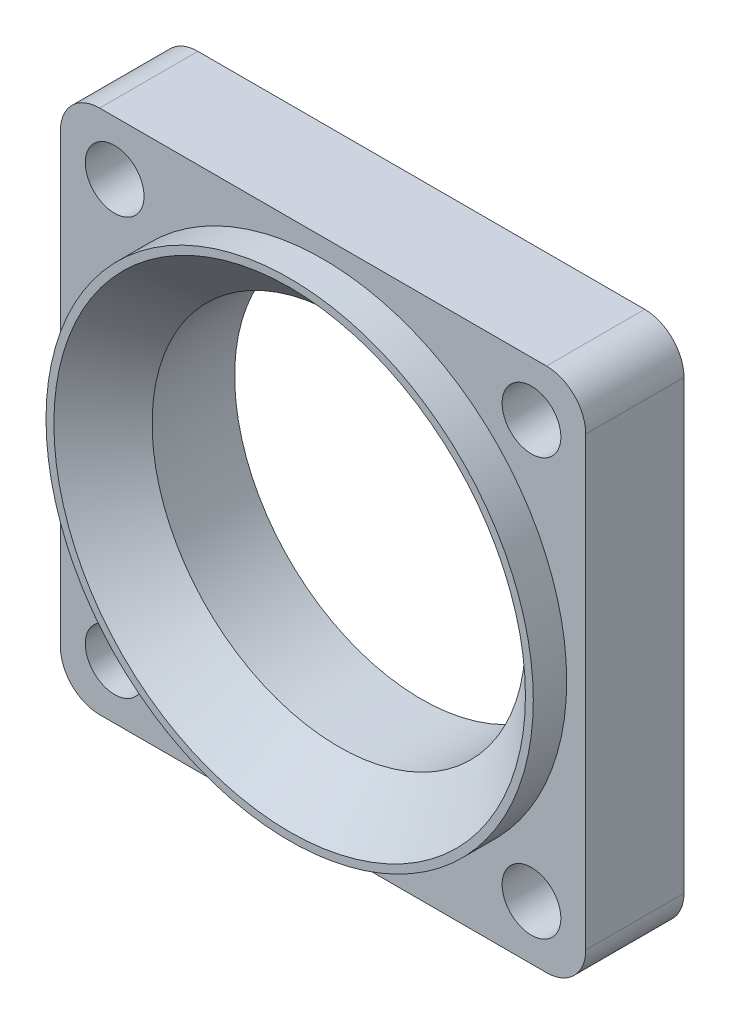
from build123d import *

# Parameters (mm, degrees)
BOSS_EXTRUDE1_START   = -6.35
SKETCH3_W             = 33.957006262
SKETCH3_H             = 33.957006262
SKETCH3_R             = 15.748
BOSS_EXTRUDE1_DEPTH   = 6.35
F_6_CLEARANCE_HOLE1_D = 3.7973
FILLET1_R             = 2.54


with BuildPart() as part:
    # Sketch2 → Revolve1 (revolve)
    with BuildSketch(Plane(origin=(0, 0, 0), x_dir=(0, 0, -1), z_dir=(1, 0, 0)), mode=Mode.PRIVATE) as revolve1_sk:
        Polygon((0, 15.748), (0, 16.978503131), (6.35, 16.978503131), (6.35, 12.065), (1.016, 12.065), (-2.159, 15.24), (-2.159, 15.748), align=None)
    revolve(revolve1_sk.sketch.rotate(Axis((0, 0, 0.145825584), (0, 0, -1)), 90), axis=Axis((0, 0, 0.145825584), (0, 0, -1)))

    # Sketch3 → Boss-Extrude1 (add)
    with BuildSketch(Plane.XY.offset(BOSS_EXTRUDE1_START)):
        Rectangle(SKETCH3_W, SKETCH3_H)
        Circle(SKETCH3_R, mode=Mode.SUBTRACT)
    extrude(amount=BOSS_EXTRUDE1_DEPTH)

    # 6 Clearance Hole1 (through all)
    with Locations(Plane(origin=(0, 0, -6.35), x_dir=(-1, 0, 0), z_dir=(0, 0, -1))):
        with Locations((-13.470384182, 13.470384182), (13.470384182, 13.470384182), (13.470384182, -13.470384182), (-13.470384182, -13.470384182)):
            Hole(F_6_CLEARANCE_HOLE1_D / 2)

    # Fillet1
    fillet1_edges = [part.edges().sort_by_distance(p)[0] for p in [
        (-16.978503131, -16.978503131, -3.175),
        (-16.978503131, 16.978503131, -3.175),
        (16.978503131, 16.978503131, -3.175),
        (16.978503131, -16.978503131, -3.175),
    ]]
    fillet(fillet1_edges, radius=FILLET1_R)


solid = part.part
